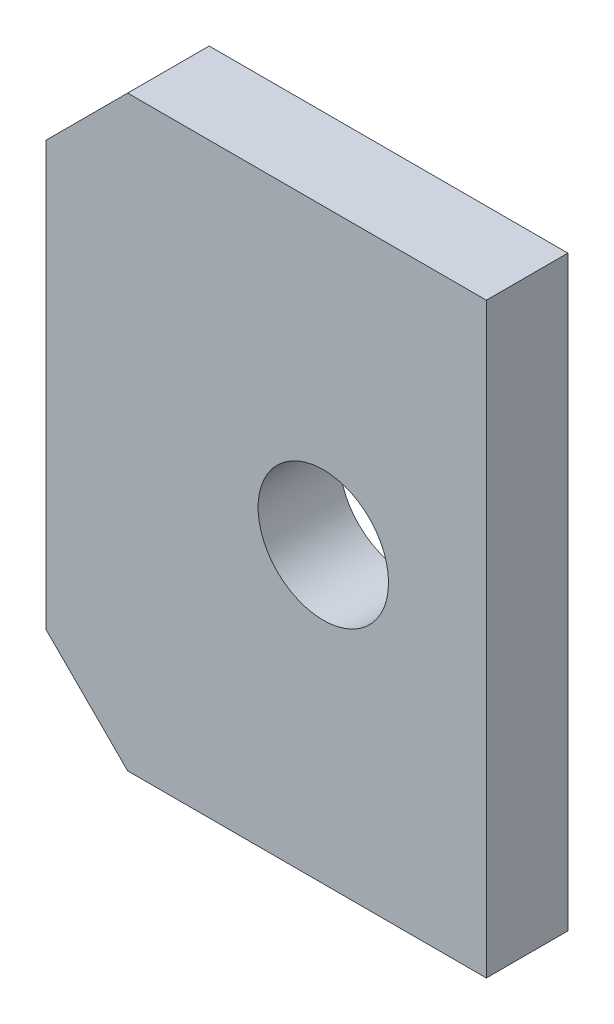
ISO-10303-21;
HEADER;
FILE_DESCRIPTION(('STEP AP214'),'2;1');
FILE_NAME('part.step','',(''),(''),'','','');
FILE_SCHEMA(('AUTOMOTIVE_DESIGN { 1 0 10303 214 1 1 1 1 }'));
ENDSEC;
DATA;
#1=APPLICATION_CONTEXT('core data for automotive mechanical design processes');
#2=APPLICATION_PROTOCOL_DEFINITION('international standard','automotive_design',2000,#1);
#3=PRODUCT_CONTEXT('',#1,'mechanical');
#4=PRODUCT('Part','Part','',(#3));
#5=PRODUCT_RELATED_PRODUCT_CATEGORY('part','',(#4));
#6=PRODUCT_DEFINITION_FORMATION('','',#4);
#7=PRODUCT_DEFINITION_CONTEXT('part definition',#1,'design');
#8=PRODUCT_DEFINITION('design','',#6,#7);
#9=PRODUCT_DEFINITION_SHAPE('','',#8);
#10=(LENGTH_UNIT() NAMED_UNIT(*) SI_UNIT(.MILLI.,.METRE.));
#11=(NAMED_UNIT(*) PLANE_ANGLE_UNIT() SI_UNIT($,.RADIAN.));
#12=(NAMED_UNIT(*) SI_UNIT($,.STERADIAN.) SOLID_ANGLE_UNIT());
#13=UNCERTAINTY_MEASURE_WITH_UNIT(LENGTH_MEASURE(1.E-05),#10,'distance_accuracy_value','');
#14=(GEOMETRIC_REPRESENTATION_CONTEXT(3) GLOBAL_UNCERTAINTY_ASSIGNED_CONTEXT((#13)) GLOBAL_UNIT_ASSIGNED_CONTEXT((#10,
#11,#12)) REPRESENTATION_CONTEXT('',''));
#15=CARTESIAN_POINT('',(0.,0.,0.));
#16=DIRECTION('',(0.,0.,1.));
#17=DIRECTION('',(1.,0.,0.));
#18=AXIS2_PLACEMENT_3D('',#15,#16,#17);
#19=CARTESIAN_POINT('',(-13.5,18.,5.));
#20=DIRECTION('',(1.,0.,0.));
#21=DIRECTION('',(0.,1.,0.));
#22=AXIS2_PLACEMENT_3D('',#19,#20,#21);
#23=PLANE('',#22);
#24=DIRECTION('',(0.,-1.,0.));
#25=VECTOR('',#24,1.);
#26=CARTESIAN_POINT('',(-13.5,18.,0.));
#27=LINE('',#26,#25);
#28=CARTESIAN_POINT('',(-13.5,13.,0.));
#29=VERTEX_POINT('',#28);
#30=CARTESIAN_POINT('',(-13.5,-13.,0.));
#31=VERTEX_POINT('',#30);
#32=EDGE_CURVE('E117',#29,#31,#27,.T.);
#33=ORIENTED_EDGE('',*,*,#32,.T.);
#34=DIRECTION('',(0.,0.,1.));
#35=VECTOR('',#34,1.);
#36=CARTESIAN_POINT('',(-13.5,-13.,5.));
#37=LINE('',#36,#35);
#38=CARTESIAN_POINT('',(-13.5,-13.,5.));
#39=VERTEX_POINT('',#38);
#40=EDGE_CURVE('E55',#31,#39,#37,.T.);
#41=ORIENTED_EDGE('',*,*,#40,.T.);
#42=DIRECTION('',(0.,-1.,0.));
#43=VECTOR('',#42,1.);
#44=CARTESIAN_POINT('',(-13.5,18.,5.));
#45=LINE('',#44,#43);
#46=CARTESIAN_POINT('',(-13.5,13.,5.));
#47=VERTEX_POINT('',#46);
#48=EDGE_CURVE('E98',#47,#39,#45,.T.);
#49=ORIENTED_EDGE('',*,*,#48,.F.);
#50=DIRECTION('',(0.,0.,-1.));
#51=VECTOR('',#50,1.);
#52=CARTESIAN_POINT('',(-13.5,13.,5.));
#53=LINE('',#52,#51);
#54=EDGE_CURVE('E134',#47,#29,#53,.T.);
#55=ORIENTED_EDGE('',*,*,#54,.T.);
#56=EDGE_LOOP('',(#33,#41,#49,#55));
#57=FACE_BOUND('',#56,.T.);
#58=ADVANCED_FACE('F34',(#57),#23,.F.);
#59=CARTESIAN_POINT('',(-13.5,-18.,5.));
#60=DIRECTION('',(0.,1.,0.));
#61=DIRECTION('',(0.,0.,1.));
#62=AXIS2_PLACEMENT_3D('',#59,#60,#61);
#63=PLANE('',#62);
#64=DIRECTION('',(1.,0.,0.));
#65=VECTOR('',#64,1.);
#66=CARTESIAN_POINT('',(-13.5,-18.,5.));
#67=LINE('',#66,#65);
#68=CARTESIAN_POINT('',(-8.49999999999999,-18.,5.));
#69=VERTEX_POINT('',#68);
#70=CARTESIAN_POINT('',(13.5,-18.,5.));
#71=VERTEX_POINT('',#70);
#72=EDGE_CURVE('E88',#69,#71,#67,.T.);
#73=ORIENTED_EDGE('',*,*,#72,.F.);
#74=DIRECTION('',(0.,0.,-1.));
#75=VECTOR('',#74,1.);
#76=CARTESIAN_POINT('',(-8.49999999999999,-18.,5.));
#77=LINE('',#76,#75);
#78=CARTESIAN_POINT('',(-8.49999999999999,-18.,0.));
#79=VERTEX_POINT('',#78);
#80=EDGE_CURVE('E107',#69,#79,#77,.T.);
#81=ORIENTED_EDGE('',*,*,#80,.T.);
#82=DIRECTION('',(1.,0.,0.));
#83=VECTOR('',#82,1.);
#84=CARTESIAN_POINT('',(-13.5,-18.,0.));
#85=LINE('',#84,#83);
#86=CARTESIAN_POINT('',(13.5,-18.,0.));
#87=VERTEX_POINT('',#86);
#88=EDGE_CURVE('E104',#79,#87,#85,.T.);
#89=ORIENTED_EDGE('',*,*,#88,.T.);
#90=DIRECTION('',(0.,0.,-1.));
#91=VECTOR('',#90,1.);
#92=CARTESIAN_POINT('',(13.5,-18.,5.));
#93=LINE('',#92,#91);
#94=EDGE_CURVE('E101',#71,#87,#93,.T.);
#95=ORIENTED_EDGE('',*,*,#94,.F.);
#96=EDGE_LOOP('',(#73,#81,#89,#95));
#97=FACE_BOUND('',#96,.T.);
#98=ADVANCED_FACE('F102',(#97),#63,.F.);
#99=CARTESIAN_POINT('',(13.5,18.,5.));
#100=DIRECTION('',(-1.,0.,0.));
#101=DIRECTION('',(0.,-1.,0.));
#102=AXIS2_PLACEMENT_3D('',#99,#100,#101);
#103=PLANE('',#102);
#104=DIRECTION('',(0.,1.,0.));
#105=VECTOR('',#104,1.);
#106=CARTESIAN_POINT('',(13.5,18.,0.));
#107=LINE('',#106,#105);
#108=CARTESIAN_POINT('',(13.5,18.,0.));
#109=VERTEX_POINT('',#108);
#110=EDGE_CURVE('E121',#87,#109,#107,.T.);
#111=ORIENTED_EDGE('',*,*,#110,.T.);
#112=DIRECTION('',(0.,0.,-1.));
#113=VECTOR('',#112,1.);
#114=CARTESIAN_POINT('',(13.5,18.,5.));
#115=LINE('',#114,#113);
#116=CARTESIAN_POINT('',(13.5,18.,5.));
#117=VERTEX_POINT('',#116);
#118=EDGE_CURVE('E108',#117,#109,#115,.T.);
#119=ORIENTED_EDGE('',*,*,#118,.F.);
#120=DIRECTION('',(0.,1.,0.));
#121=VECTOR('',#120,1.);
#122=CARTESIAN_POINT('',(13.5,18.,5.));
#123=LINE('',#122,#121);
#124=EDGE_CURVE('E92',#71,#117,#123,.T.);
#125=ORIENTED_EDGE('',*,*,#124,.F.);
#126=ORIENTED_EDGE('',*,*,#94,.T.);
#127=EDGE_LOOP('',(#111,#119,#125,#126));
#128=FACE_BOUND('',#127,.T.);
#129=ADVANCED_FACE('F110',(#128),#103,.F.);
#130=CARTESIAN_POINT('',(-13.5,18.,5.));
#131=DIRECTION('',(0.,-1.,0.));
#132=DIRECTION('',(0.,0.,-1.));
#133=AXIS2_PLACEMENT_3D('',#130,#131,#132);
#134=PLANE('',#133);
#135=DIRECTION('',(-1.,0.,0.));
#136=VECTOR('',#135,1.);
#137=CARTESIAN_POINT('',(-13.5,18.,0.));
#138=LINE('',#137,#136);
#139=CARTESIAN_POINT('',(-8.49999999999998,18.,0.));
#140=VERTEX_POINT('',#139);
#141=EDGE_CURVE('E123',#109,#140,#138,.T.);
#142=ORIENTED_EDGE('',*,*,#141,.T.);
#143=DIRECTION('',(0.,0.,1.));
#144=VECTOR('',#143,1.);
#145=CARTESIAN_POINT('',(-8.49999999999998,18.,5.));
#146=LINE('',#145,#144);
#147=CARTESIAN_POINT('',(-8.49999999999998,18.,5.));
#148=VERTEX_POINT('',#147);
#149=EDGE_CURVE('E11',#140,#148,#146,.T.);
#150=ORIENTED_EDGE('',*,*,#149,.T.);
#151=DIRECTION('',(-1.,0.,0.));
#152=VECTOR('',#151,1.);
#153=CARTESIAN_POINT('',(-13.5,18.,5.));
#154=LINE('',#153,#152);
#155=EDGE_CURVE('E112',#117,#148,#154,.T.);
#156=ORIENTED_EDGE('',*,*,#155,.F.);
#157=ORIENTED_EDGE('',*,*,#118,.T.);
#158=EDGE_LOOP('',(#142,#150,#156,#157));
#159=FACE_BOUND('',#158,.T.);
#160=ADVANCED_FACE('F146',(#159),#134,.F.);
#161=CARTESIAN_POINT('',(-13.5,-18.,5.));
#162=DIRECTION('',(0.,0.,1.));
#163=DIRECTION('',(1.,0.,0.));
#164=AXIS2_PLACEMENT_3D('',#161,#162,#163);
#165=PLANE('',#164);
#166=CARTESIAN_POINT('',(3.5,0.,5.));
#167=DIRECTION('',(0.,0.,1.));
#168=DIRECTION('',(1.,0.,0.));
#169=AXIS2_PLACEMENT_3D('',#166,#167,#168);
#170=CIRCLE('',#169,4.);
#171=CARTESIAN_POINT('',(7.5,0.,5.));
#172=VERTEX_POINT('',#171);
#173=EDGE_CURVE('E128',#172,#172,#170,.T.);
#174=ORIENTED_EDGE('',*,*,#173,.F.);
#175=EDGE_LOOP('',(#174));
#176=FACE_BOUND('',#175,.T.);
#177=ORIENTED_EDGE('',*,*,#48,.T.);
#178=DIRECTION('',(-0.707106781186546,0.707106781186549,0.));
#179=VECTOR('',#178,1.);
#180=CARTESIAN_POINT('',(-11.,-15.5,5.));
#181=LINE('',#180,#179);
#182=EDGE_CURVE('E42',#39,#69,#181,.F.);
#183=ORIENTED_EDGE('',*,*,#182,.T.);
#184=ORIENTED_EDGE('',*,*,#72,.T.);
#185=ORIENTED_EDGE('',*,*,#124,.T.);
#186=ORIENTED_EDGE('',*,*,#155,.T.);
#187=DIRECTION('',(0.707106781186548,0.707106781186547,0.));
#188=VECTOR('',#187,1.);
#189=CARTESIAN_POINT('',(-29.,-2.49999999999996,5.));
#190=LINE('',#189,#188);
#191=EDGE_CURVE('E138',#148,#47,#190,.F.);
#192=ORIENTED_EDGE('',*,*,#191,.T.);
#193=EDGE_LOOP('',(#177,#183,#184,#185,#186,#192));
#194=FACE_BOUND('',#193,.T.);
#195=ADVANCED_FACE('F90',(#176,#194),#165,.T.);
#196=CARTESIAN_POINT('',(-13.5,-18.,0.));
#197=DIRECTION('',(0.,0.,1.));
#198=DIRECTION('',(1.,0.,0.));
#199=AXIS2_PLACEMENT_3D('',#196,#197,#198);
#200=PLANE('',#199);
#201=CARTESIAN_POINT('',(3.5,0.,0.));
#202=DIRECTION('',(0.,0.,1.));
#203=DIRECTION('',(1.,0.,0.));
#204=AXIS2_PLACEMENT_3D('',#201,#202,#203);
#205=CIRCLE('',#204,4.);
#206=CARTESIAN_POINT('',(7.5,0.,0.));
#207=VERTEX_POINT('',#206);
#208=EDGE_CURVE('E119',#207,#207,#205,.T.);
#209=ORIENTED_EDGE('',*,*,#208,.T.);
#210=EDGE_LOOP('',(#209));
#211=FACE_BOUND('',#210,.T.);
#212=ORIENTED_EDGE('',*,*,#88,.F.);
#213=DIRECTION('',(0.707106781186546,-0.707106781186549,0.));
#214=VECTOR('',#213,1.);
#215=CARTESIAN_POINT('',(-8.49999999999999,-18.,0.));
#216=LINE('',#215,#214);
#217=EDGE_CURVE('E132',#79,#31,#216,.F.);
#218=ORIENTED_EDGE('',*,*,#217,.T.);
#219=ORIENTED_EDGE('',*,*,#32,.F.);
#220=DIRECTION('',(-0.707106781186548,-0.707106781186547,0.));
#221=VECTOR('',#220,1.);
#222=CARTESIAN_POINT('',(-13.5,13.,0.));
#223=LINE('',#222,#221);
#224=EDGE_CURVE('E130',#29,#140,#223,.F.);
#225=ORIENTED_EDGE('',*,*,#224,.T.);
#226=ORIENTED_EDGE('',*,*,#141,.F.);
#227=ORIENTED_EDGE('',*,*,#110,.F.);
#228=EDGE_LOOP('',(#212,#218,#219,#225,#226,#227));
#229=FACE_BOUND('',#228,.T.);
#230=ADVANCED_FACE('F145',(#211,#229),#200,.F.);
#231=CARTESIAN_POINT('',(3.5,0.,5.));
#232=DIRECTION('',(0.,0.,1.));
#233=DIRECTION('',(1.,0.,0.));
#234=AXIS2_PLACEMENT_3D('',#231,#232,#233);
#235=CYLINDRICAL_SURFACE('',#234,4.);
#236=ORIENTED_EDGE('',*,*,#173,.T.);
#237=EDGE_LOOP('',(#236));
#238=FACE_BOUND('',#237,.T.);
#239=ORIENTED_EDGE('',*,*,#208,.F.);
#240=EDGE_LOOP('',(#239));
#241=FACE_BOUND('',#240,.T.);
#242=ADVANCED_FACE('F165',(#238,#241),#235,.F.);
#243=CARTESIAN_POINT('',(-8.49999999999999,-18.,5.));
#244=DIRECTION('',(0.707106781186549,0.707106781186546,0.));
#245=DIRECTION('',(-0.707106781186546,0.707106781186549,0.));
#246=AXIS2_PLACEMENT_3D('',#243,#244,#245);
#247=PLANE('',#246);
#248=ORIENTED_EDGE('',*,*,#182,.F.);
#249=ORIENTED_EDGE('',*,*,#40,.F.);
#250=ORIENTED_EDGE('',*,*,#217,.F.);
#251=ORIENTED_EDGE('',*,*,#80,.F.);
#252=EDGE_LOOP('',(#248,#249,#250,#251));
#253=FACE_BOUND('',#252,.T.);
#254=ADVANCED_FACE('F163',(#253),#247,.F.);
#255=CARTESIAN_POINT('',(-13.5,13.,5.));
#256=DIRECTION('',(0.707106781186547,-0.707106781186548,0.));
#257=DIRECTION('',(0.707106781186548,0.707106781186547,0.));
#258=AXIS2_PLACEMENT_3D('',#255,#256,#257);
#259=PLANE('',#258);
#260=ORIENTED_EDGE('',*,*,#191,.F.);
#261=ORIENTED_EDGE('',*,*,#149,.F.);
#262=ORIENTED_EDGE('',*,*,#224,.F.);
#263=ORIENTED_EDGE('',*,*,#54,.F.);
#264=EDGE_LOOP('',(#260,#261,#262,#263));
#265=FACE_BOUND('',#264,.T.);
#266=ADVANCED_FACE('F36',(#265),#259,.F.);
#267=CLOSED_SHELL('',(#58,#98,#129,#160,#195,#230,#242,#254,#266));
#268=MANIFOLD_SOLID_BREP('B2',#267);
#269=ADVANCED_BREP_SHAPE_REPRESENTATION('',(#18,#268),#14);
#270=SHAPE_DEFINITION_REPRESENTATION(#9,#269);
ENDSEC;
END-ISO-10303-21;
